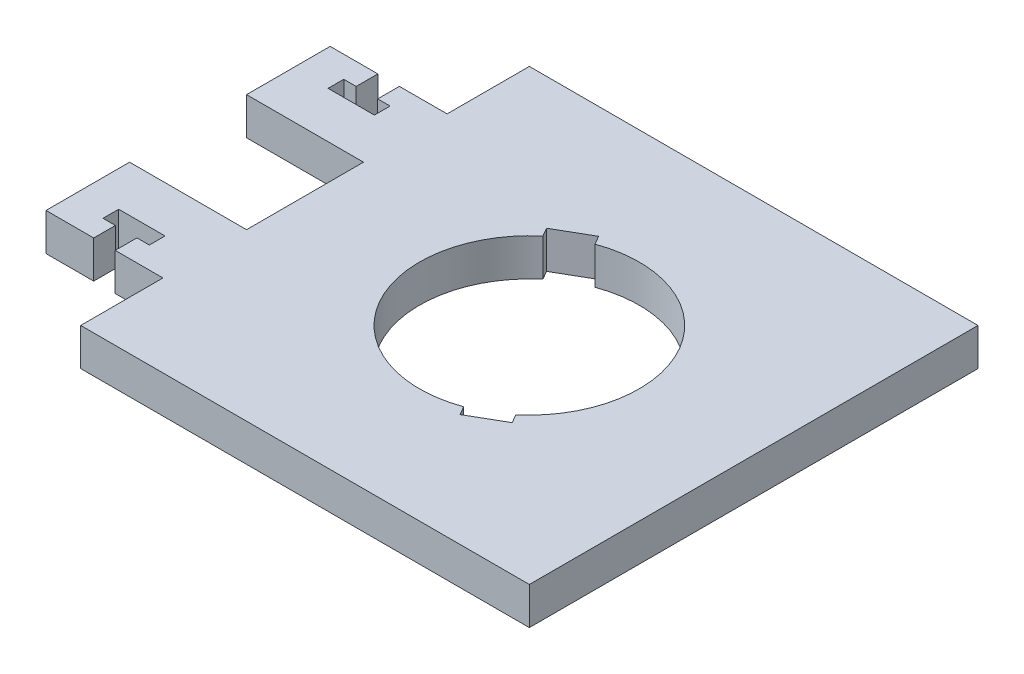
from build123d import *

# Parameters (mm, degrees)
BOSS_EXTRUDE1_DEPTH = 6.35


with BuildPart() as part:
    # Sketch1 → Boss-Extrude1 (new body)
    with BuildSketch(Plane(origin=(0, 0, 0), x_dir=(1, 0, 0), z_dir=(0, 1, 0))):
        Polygon((-38.1, -38.1), (38.1, -38.1), (38.1, 38.1), (-38.1, 38.1), (-38.1, 24.13), (-46.2026, 24.13), (-46.2026, 20.447), (-44.0944, 20.447), (-44.0944, 17.78), (-51.9684, 17.78), (-51.9684, 20.447), (-49.8602, 20.447), (-49.8602, 24.13), (-57.9628, 24.13), (-57.9628, 9.9314), (-38.1, 9.9314), (-38.1, -9.9314), (-57.9628, -9.9314), (-57.9628, -24.13), (-49.8602, -24.13), (-49.8602, -20.447), (-51.9684, -20.447), (-51.9684, -17.78), (-44.0944, -17.78), (-44.0944, -20.447), (-46.2026, -20.447), (-46.2026, -24.13), (-38.1, -24.13), align=None)
        with BuildLine():
            Line((7.227071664, -18.99759929), (12.838867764, -15.757627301))
            Line((12.838867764, -15.757627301), (11.99371709, -14.293783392))
            ThreePointArc((11.99371709, -14.293783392), (16.159242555, 9.329543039), (-6.381920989, 17.533755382))
            Line((-6.381920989, 17.533755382), (-7.227071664, 18.99759929))
            Line((-7.227071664, 18.99759929), (-12.838867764, 15.757627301))
            Line((-12.838867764, 15.757627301), (-11.99371709, 14.293783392))
            ThreePointArc((-11.99371709, 14.293783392), (-16.159242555, -9.329543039), (6.381920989, -17.533755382))
            Line((6.381920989, -17.533755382), (7.227071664, -18.99759929))
        make_face(mode=Mode.SUBTRACT)
    extrude(amount=-BOSS_EXTRUDE1_DEPTH)


solid = part.part
